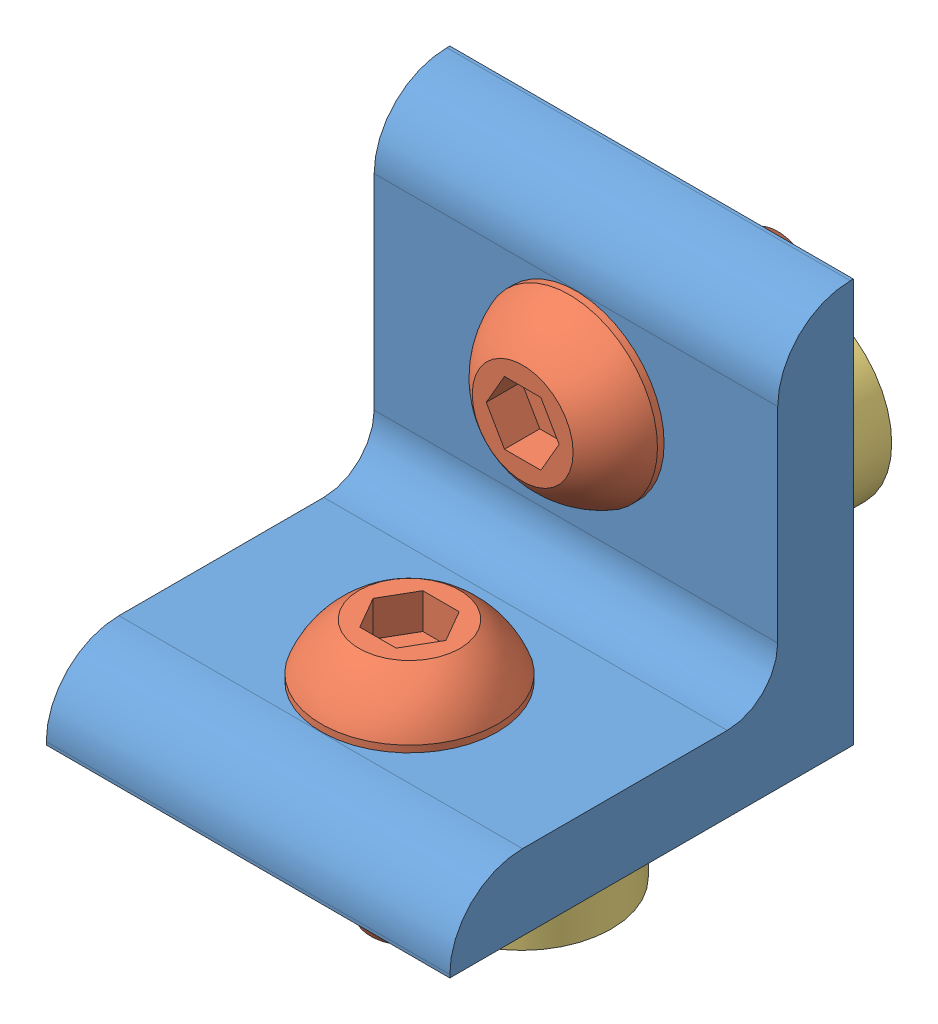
SolidWorks assembly 80-20 90 Degree Bracket Assy.SLDASM, configuration Default (file format 10000). Lengths in mm.
Overall size (25.4 33.34 33.34).
5 component instances, 3 part files, 10 mates.
Components (placement in the parent):
- 80-20 90 Degree Angle Bracket-1: 80-20 90 Degree Angle Bracket.SLDPRT [Default] at (-9.1289 2.4785 8.6086) size (25.4 25.4 25.4)
- 0.25-20 Button Head Cap Screw (BHCS)-1: 0.25-20 Button Head Cap Screw (BHCS).SLDPRT [Default] at (3.5711 10.5938 23.8486) x (1 0 0) z (0 -1 0) size (11.1 11.1 16.05)
- 80-20 0.25-20 T-NUT-1: 80-20 0.25-20 T-NUT.SLDPRT [Default] at (-114.7814 2.4785 -102.0845) x (1 0 0) z (0 -1 0) size (25.4 11.25 2.41)
- 0.25-20 Button Head Cap Screw (BHCS)-2: 0.25-20 Button Head Cap Screw (BHCS).SLDPRT [Default] at (3.5711 17.7185 16.7239) x (1 0 0) z (0 0 -1) size (11.1 11.1 16.05)
- 80-20 0.25-20 T-NUT-2: 80-20 0.25-20 T-NUT.SLDPRT [Default] at (-114.7814 143.6516 8.6086) x (1 0 0) z (0 0 -1) size (25.4 11.25 2.41)
Mates (geometry in assembly coordinates):
- Concentric1: concentric anti-aligned: cylinder of 80-20 90 Degree Angle Bracket-1 through (3.5711 2.4785 23.8486) axis (0 -1 0) radius 3.2639; cylinder of 0.25-20 Button Head Cap Screw (BHCS)-1 through (3.5711 -5.459 23.8486) axis (0 1 0) radius 3.175
- Coincident1: coincident anti-aligned: plane of 80-20 90 Degree Angle Bracket-1 through (16.2711 7.241 29.4366) normal (0 1 0); plane of 0.25-20 Button Head Cap Screw (BHCS)-1 through (9.121 7.241 23.8486) normal (0 -1 0)
- Concentric2: concentric anti-aligned: cylinder of 0.25-20 Button Head Cap Screw (BHCS)-1 through (3.5711 -5.459 23.8486) axis (0 1 0) radius 3.175; cylinder of 80-20 0.25-20 T-NUT-1 through (3.5711 2.4795 23.8486) axis (0 -1 0) radius 3.175
- Coincident2: coincident anti-aligned: plane of 80-20 90 Degree Angle Bracket-1 through (16.2711 2.4785 8.6086) normal (0 -1 0); plane of 80-20 0.25-20 T-NUT-1 through (-3.5028 2.4785 23.8486) normal (0 1 0)
- Parallel1: parallel anti-aligned: plane of 80-20 0.25-20 T-NUT-1 through (-3.5028 0.0655 18.2225) normal (0 0 -1); plane of assembly through (0 0 0) normal (0 0 1)
- Concentric3: concentric anti-aligned: cylinder of 80-20 90 Degree Angle Bracket-1 through (3.5711 17.7185 8.6086) axis (0 0 -1) radius 3.2639; cylinder of 0.25-20 Button Head Cap Screw (BHCS)-2 through (3.5711 17.7185 0.6711) axis (0 0 1) radius 3.175
- Coincident5: coincident anti-aligned: plane of 80-20 90 Degree Angle Bracket-1 through (16.2711 10.416 13.3711) normal (0 0 1); plane of 0.25-20 Button Head Cap Screw (BHCS)-2 through (9.121 17.7185 13.3711) normal (0 0 -1)
- Concentric4: concentric anti-aligned: cylinder of 0.25-20 Button Head Cap Screw (BHCS)-2 through (3.5711 17.7185 0.6711) axis (0 0 1) radius 3.175; cylinder of 80-20 0.25-20 T-NUT-2 through (3.5711 17.7185 8.6096) axis (0 0 -1) radius 3.175
- Parallel2: parallel aligned: plane of 80-20 0.25-20 T-NUT-2 through (-3.5028 23.3446 6.1956) normal (0 1 0); plane of assembly through (0 0 0) normal (0 1 0)
- Coincident7: coincident anti-aligned: plane of 80-20 90 Degree Angle Bracket-1 through (16.2711 27.8785 8.6086) normal (0 0 -1); plane of 80-20 0.25-20 T-NUT-2 through (-3.5028 17.7185 8.6086) normal (0 0 1)
